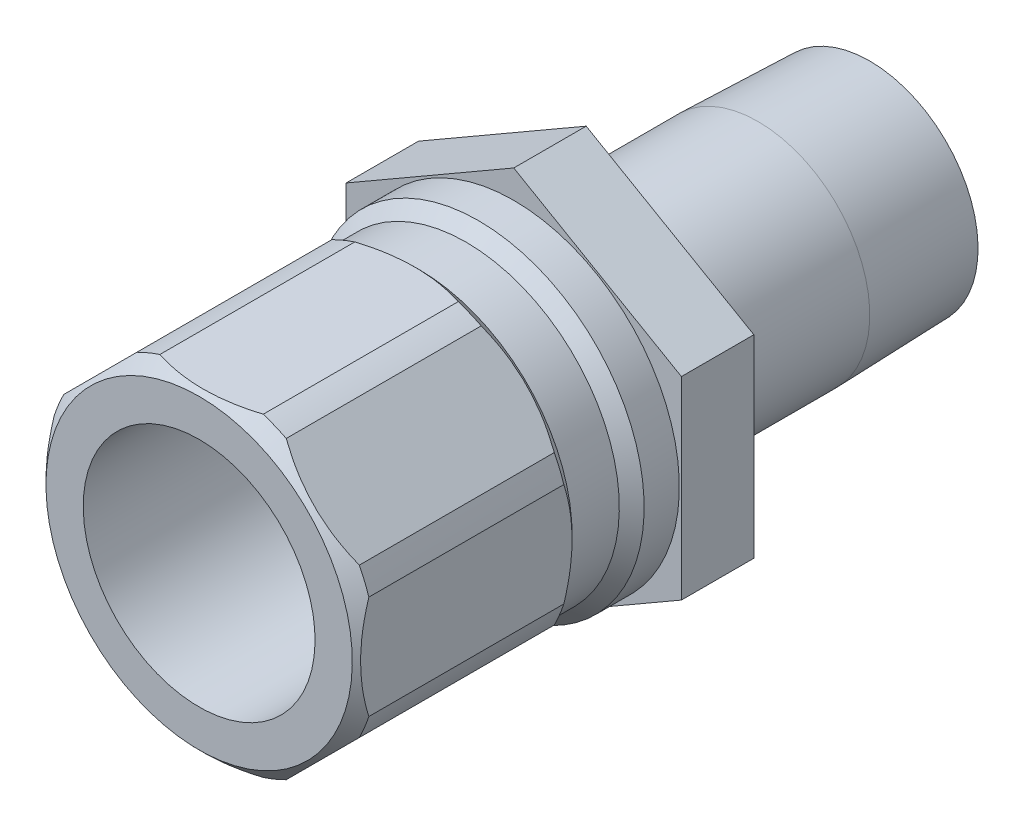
from build123d import *

# Parameters (mm, degrees)
SKETCH2_R           = 4.7625
BOSS_EXTRUDE1_DEPTH = 4.445
CUT_EXTRUDE2_START  = 5.8166
SKETCH3_OUTSIDE_W   = 32.93
SKETCH3_OUTSIDE_H   = 36.112
CUT_EXTRUDE2_DEPTH  = 22.092119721


with BuildPart() as part:
    # Sketch1 → Revolve1 (revolve)
    with BuildSketch(Plane(origin=(0, 0, 0), x_dir=(0, 0, -1), z_dir=(1, 0, 0))):
        Polygon((-19.304, 7.112), (-19.304, 9.398), (-18.542, 10.16), (-6.5786, 10.16), (-5.8166, 9.398), (-2.921, 9.398), (-2.159, 10.16), (0, 10.16), (0, 6.858), (14.986, 6.858), (21.844, 6.643688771), (21.844, 4.7625), (-0.27474869, 4.7625), (-1.524, 7.112), align=None)
    revolve(axis=Axis((0, 0, 0), (0, 0, 1)))

    # Sketch2 → Boss-Extrude1 (add)
    with BuildSketch(Plane.XY):
        Polygon((-10.287, 5.939202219), (-10.287, -5.939202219), (0, -11.878404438), (10.287, -5.939202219), (10.287, 5.939202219), (0, 11.878404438), align=None)
        with Locations(Location((0, 0, 0), (0, 0, 90))):
            Circle(SKETCH2_R, mode=Mode.SUBTRACT)
    extrude(amount=-BOSS_EXTRUDE1_DEPTH)

    # Sketch3 outside → Cut-Extrude2 (cut, through all)
    with BuildSketch(Plane.XY.offset(CUT_EXTRUDE2_START)):
        Rectangle(SKETCH3_OUTSIDE_W, SKETCH3_OUTSIDE_H)
        Polygon((9.652, -3.997989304), (9.652, 3.997989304), (3.997989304, 9.652), (-3.997989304, 9.652), (-9.652, 3.997989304), (-9.652, -3.997989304), (-3.997989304, -9.652), (3.997989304, -9.652), align=None, mode=Mode.SUBTRACT)
    extrude(amount=CUT_EXTRUDE2_DEPTH, mode=Mode.SUBTRACT)


solid = part.part
